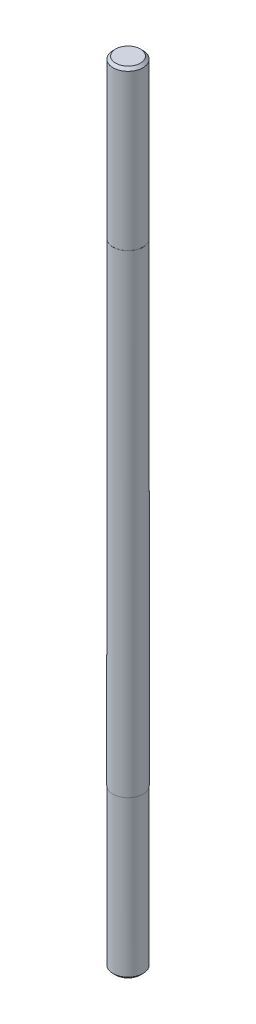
from build123d import *

# Parameters (mm, degrees)
SKETCH1_R          = 2
EXTRUDE1_DEPTH     = 105
CUT_EXTRUDE1_START = -21
SKETCH2_R          = 2
SKETCH2_R_2        = 1.99
CUT_EXTRUDE1_DEPTH = 21
SKETCH3_R          = 2
SKETCH3_R_2        = 1.999
CUT_EXTRUDE2_DEPTH = 21
CHAMFER1_SIZE      = 0.35


with BuildPart() as part:
    # Sketch1 → Extrude1 (new body)
    with BuildSketch(Plane(origin=(0, 0, 0), x_dir=(1, 0, 0), z_dir=(0, 1, 0))):
        with Locations(Location((0, 0, 0), (0, 0, 270))):
            Circle(SKETCH1_R)
    extrude(amount=EXTRUDE1_DEPTH)

    # Sketch2 → Cut-Extrude1 (cut)
    with BuildSketch(Plane(origin=(0, 105, 0), x_dir=(-1, 0, 0), z_dir=(0, 1, 0)).offset(CUT_EXTRUDE1_START)):
        with Locations(Location((0, 0, 0), (0, 0, 90))):
            Circle(SKETCH2_R)
        with Locations(Location((0, 0, 0), (0, 0, 90))):
            Circle(SKETCH2_R_2, mode=Mode.SUBTRACT)
    extrude(amount=CUT_EXTRUDE1_DEPTH, mode=Mode.SUBTRACT)

    # Sketch3 → Cut-Extrude2 (cut)
    with BuildSketch(Plane.XZ):
        with Locations(Location((0, 0, 0), (0, 0, 270))):
            Circle(SKETCH3_R)
        with Locations(Location((0, 0, 0), (0, 0, 270))):
            Circle(SKETCH3_R_2, mode=Mode.SUBTRACT)
    extrude(amount=-CUT_EXTRUDE2_DEPTH, mode=Mode.SUBTRACT)

    # Chamfer1
    chamfer1_edges = [part.edges().sort_by_distance(p)[0] for p in [
        (0, 0, 1.999),
        (0, 105, -1.99),
    ]]
    chamfer(chamfer1_edges, length=CHAMFER1_SIZE)


solid = part.part
